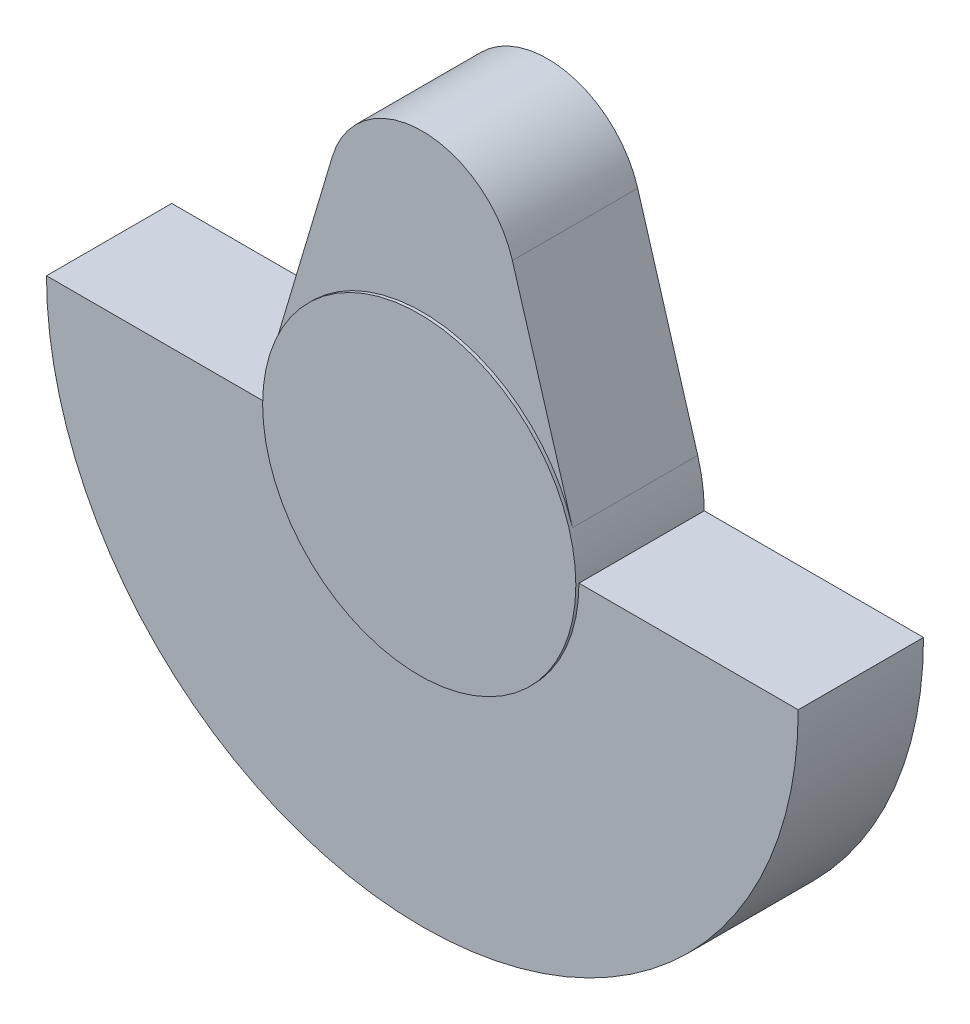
from build123d import *

# Parameters (mm, degrees)
BOSS_EXTRUDE1_DEPTH      = 1
BOSS_EXTRUDE1_DEPTH_BACK = 40
SKETCH1_R                = 50
BOSS_EXTRUDE2_DEPTH      = 40


with BuildPart() as part:
    # Sketch1 → Boss-Extrude1 (new, two sides: drawn at the far end of the back side and taken through both)
    with BuildSketch(Plane.XY.offset(-BOSS_EXTRUDE1_DEPTH_BACK)):
        Circle(SKETCH1_R)
    extrude(amount=BOSS_EXTRUDE1_DEPTH + BOSS_EXTRUDE1_DEPTH_BACK)

    # Sketch1_3 → Boss-Extrude2 (add)
    with BuildSketch(Plane.XY):
        with BuildLine():
            ThreePointArc((50, 0), (0, -50), (-50, 0))
            Line((-50, 0), (-120, 0))
            ThreePointArc((-120, 0), (0, -120), (120, 0))
            Line((120, 0), (50, 0))
        make_face()
        with BuildLine():
            ThreePointArc((28.749445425, 78.571428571), (0, 100), (-28.749445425, 78.571428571))
            Line((-28.749445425, 78.571428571), (-47.915742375, 14.285714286))
            ThreePointArc((-47.915742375, 14.285714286), (0, 50), (47.915742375, 14.285714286))
            Line((47.915742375, 14.285714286), (28.749445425, 78.571428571))
        make_face()
    extrude(amount=-BOSS_EXTRUDE2_DEPTH)


solid = part.part
